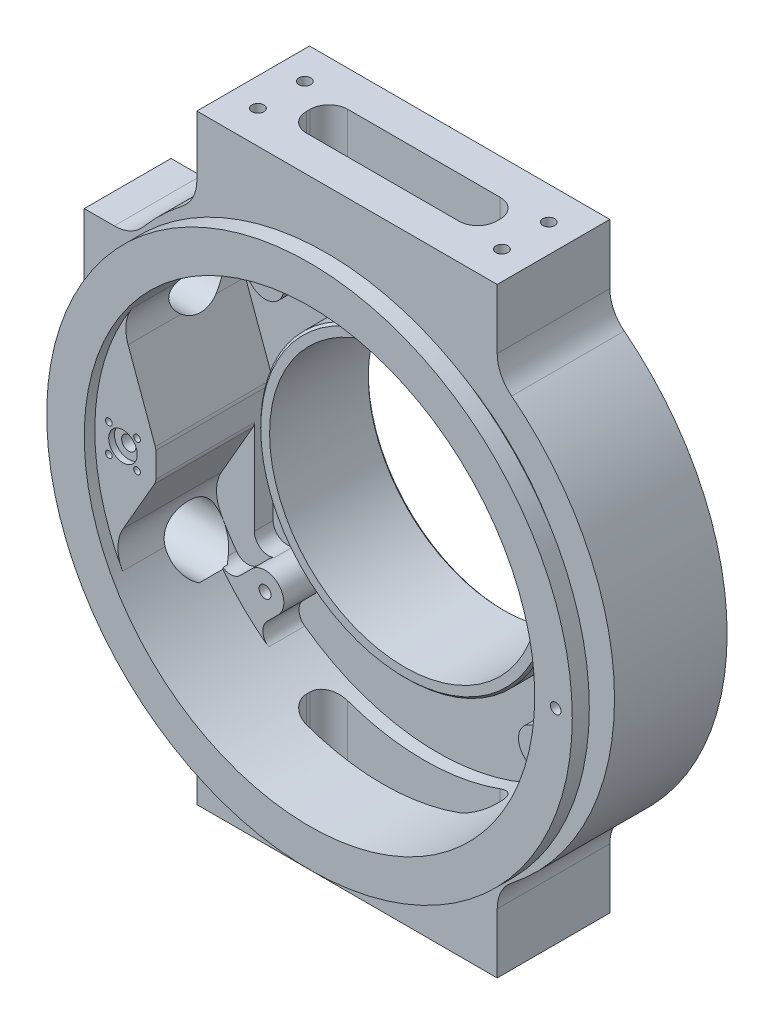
from build123d import *

# Parameters (mm, degrees)
BOSS_EXTRUDE1_DEPTH              = 19.05
SKETCH3_R                        = 74.2188
CUT_EXTRUDE2_DEPTH               = 158.602855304
SKETCH5_R                        = 74.2188
SKETCH5_R_2                      = 45.6438
BOSS_EXTRUDE2_DEPTH              = 47.22876
CUT_EXTRUDE3_DEPTH               = 114.3
F_10_32_TAPPED_HOLE1_D           = 4.0386
F_10_32_TAPPED_HOLE1_DEPTH       = 16.764
F_10_32_TAPPED_HOLE1_TIP         = 1.213317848
F_10_32_TAPPED_HOLE2_D           = 4.0386
F_10_32_TAPPED_HOLE2_DEPTH       = 16.764
F_10_32_TAPPED_HOLE2_TIP         = 1.213317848
SKETCH15_OUTSIDE_W               = 293.192
SKETCH15_OUTSIDE_H               = 267.792
CUT_EXTRUDE7_DEPTH               = 41.275
ROD_POCKET_DEPTH                 = 8.73125
CUT_EXTRUDE11_DEPTH              = 8.73125
SKETCH13_R                       = 2.413
CUT_EXTRUDE5_DEPTH               = 47.22876
CUT_EXTRUDE6_DEPTH               = 39.6875
SKETCH16_R                       = 4.826
CUT_EXTRUDE8_DEPTH               = 1.9558
CHAMFER1_SIZE                    = 3.175
BOSS_EXTRUDE4_DEPTH              = 12.2428
F_10_32_TAPPED_HOLE3_D           = 4.0386
F_10_32_TAPPED_HOLE3_DEPTH       = 12.7
SKETCH23_R                       = 6.35
CUT_EXTRUDE9_DEPTH               = 41.275
F_4_40_TAPPED_HOLE1_D            = 2.2606
F_4_40_TAPPED_HOLE1_DEPTH        = 11.43
F_4_40_TAPPED_HOLE1_TIP          = 0.679152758
BOSS_EXTRUDE5_DEPTH              = 5.15874
SKETCH24_R                       = 9.525
CUT_EXTRUDE10_DEPTH              = 28.575
SKETCH30_R                       = 49.403
SKETCH30_R_2                     = 45.6438
BOSS_EXTRUDE7_DEPTH              = 11.1125
CHAMFER2_SIZE                    = 0.762
BOSS_EXTRUDE8_DEPTH              = 1.18999
SKETCH33_W                       = 1.199119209
SKETCH33_H                       = 2.635463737
CUT_EXTRUDE12_DEPTH              = 1.18999
CUT_EXTRUDE13_DEPTH              = 150.716063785
CUT_EXTRUDE13_DEPTH_BACK         = 150.716063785
F_6_32_TAPPED_HOLE1_D            = 2.7051
F_6_32_TAPPED_HOLE1_DEPTH        = 10.9728
F_6_32_TAPPED_HOLE1_TIP          = 0.81269403
F_42_0_0935_DIAMETER_HOLE1_D     = 2.3749
F_42_0_0935_DIAMETER_HOLE1_DEPTH = 4.7625
F_42_0_0935_DIAMETER_HOLE1_TIP   = 0.713491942
F_10_32_TAPPED_HOLE4_D           = 4.0386
F_10_32_TAPPED_HOLE4_DEPTH       = 13.6144
F_10_32_TAPPED_HOLE4_TIP         = 1.213317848
SKETCH43_R                       = 1.778
CUT_EXTRUDE14_DEPTH              = 9.525


with BuildPart() as part:
    # Sketch1 → Boss-Extrude1 (new, symmetric)
    with BuildSketch(Plane.XY):
        with BuildLine():
            Line((52.363441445, 101.6), (-52.363441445, 101.6))
            ThreePointArc((-52.363441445, 101.6), (-114.3, 0), (-52.363441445, -101.6))
            Line((-52.363441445, -101.6), (52.363441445, -101.6))
            ThreePointArc((52.363441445, -101.6), (114.3, 0), (52.363441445, 101.6))
        make_face()
    extrude(amount=BOSS_EXTRUDE1_DEPTH, both=True)

    # Sketch3 → Cut-Extrude2 (cut, through all)
    with BuildSketch(Plane.XY.offset(19.05)):
        Circle(SKETCH3_R)
    extrude(amount=-CUT_EXTRUDE2_DEPTH, mode=Mode.SUBTRACT)

    # Sketch4 → Revolve1 (revolve)
    with BuildSketch(Plane(origin=(0, 0, 0), x_dir=(1, 0, 0), z_dir=(0, 1, 0))):
        Polygon((76.2, -31.75), (76.2, -28.17876), (74.2188, -28.17876), (74.2188, -19.05), (79.375, -19.05), (79.375, -22.517383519), (88.9, -25.9842), (88.9, -31.75), align=None)
        Polygon((50.8, 19.05), (50.8, 22.517383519), (60.325, 25.9842), (60.325, 31.75), (50.8, 31.75), (50.8, 33.782), (50.038, 34.544), (46.4058, 34.544), (45.6438, 33.782), (45.6438, 19.05), align=None)
    revolve(axis=Axis((0, 0, 0), (0, 0, -1)))


with BuildPart() as revolve1_piece_1:
    # of the separate pieces the step leaves, piece 1, a body of its own (revolve1_pieces)
    add(part.part.solids().sort_by_distance((52.363441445, 101.6, -19.05))[0])



with BuildPart() as revolve1_piece_2:
    # of the separate pieces the step leaves, piece 2, a body of its own (revolve1_pieces)
    add(part.part.solids().sort_by_distance((50.8, 0, -19.05))[0])


with BuildPart() as revolve1_piece_1_1:
    add(revolve1_piece_1.part)

    add(revolve1_piece_2.part)  # Boss-Extrude2 merges Revolve1 piece 2
    # Sketch5 → Boss-Extrude2 (add)
    with BuildSketch(Plane.XY.offset(-19.05)):
        Circle(SKETCH5_R)
        Circle(SKETCH5_R_2, mode=Mode.SUBTRACT)
    extrude(amount=BOSS_EXTRUDE2_DEPTH)

    # Sketch6 → Cut-Extrude3 (cut, symmetric)
    with BuildSketch(Plane(origin=(0, 0, 0), x_dir=(1, 0, 0), z_dir=(0, 1, 0))):
        with BuildLine():
            Line((32.1437, -0.635), (32.1437, 0.635))
            ThreePointArc((32.1437, 0.635), (30.283828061, 5.125128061), (25.7937, 6.985))
            Line((25.7937, 6.985), (-25.7937, 6.985))
            ThreePointArc((-25.7937, 6.985), (-30.283828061, 5.125128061), (-32.1437, 0.635))
            Line((-32.1437, 0.635), (-32.1437, -0.635))
            ThreePointArc((-32.1437, -0.635), (-30.283828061, -5.125128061), (-25.7937, -6.985))
            Line((-25.7937, -6.985), (25.7937, -6.985))
            ThreePointArc((25.7937, -6.985), (30.283828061, -5.125128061), (32.1437, -0.635))
        make_face()
    extrude(amount=CUT_EXTRUDE3_DEPTH, both=True, mode=Mode.SUBTRACT)

    # 10-32 Tapped Hole1
    with Locations(Plane(origin=(0, 101.6, 0), x_dir=(-1, 0, 0), z_dir=(0, 1, 0))):
        with Locations((-41.275, 7.9375), (-41.275, -7.9375), (41.275, -7.9375), (41.275, 7.9375)):
            Hole(F_10_32_TAPPED_HOLE1_D / 2, depth=F_10_32_TAPPED_HOLE1_DEPTH)
            with Locations((0, 0, -(F_10_32_TAPPED_HOLE1_DEPTH + F_10_32_TAPPED_HOLE1_TIP / 2))):  # 118° drill point
                Cone(0, F_10_32_TAPPED_HOLE1_D / 2, F_10_32_TAPPED_HOLE1_TIP, mode=Mode.SUBTRACT)

    # 10-32 Tapped Hole2
    with Locations(Plane.XZ.offset(101.6)):
        with Locations((41.275, -7.9375), (-41.275, 7.9375), (-41.275, -7.9375), (41.275, 7.9375)):
            Hole(F_10_32_TAPPED_HOLE2_D / 2, depth=F_10_32_TAPPED_HOLE2_DEPTH)
            with Locations((0, 0, -(F_10_32_TAPPED_HOLE2_DEPTH + F_10_32_TAPPED_HOLE2_TIP / 2))):  # 118° drill point
                Cone(0, F_10_32_TAPPED_HOLE2_D / 2, F_10_32_TAPPED_HOLE2_TIP, mode=Mode.SUBTRACT)

    # Sketch15 outside → Cut-Extrude7 (cut)
    with BuildSketch(Plane.XY.offset(19.05)):
        Rectangle(SKETCH15_OUTSIDE_W, SKETCH15_OUTSIDE_H)
        with BuildLine():
            Line((50.8, 101.6), (50.8, 81.335171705))
            ThreePointArc((50.8, 81.335171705), (52.086293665, 75.765853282), (55.684615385, 71.324689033))
            ThreePointArc((55.684615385, 71.324689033), (90.4875, 0), (55.684615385, -71.324689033))
            ThreePointArc((55.684615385, -71.324689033), (52.086293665, -75.765853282), (50.8, -81.335171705))
            Line((50.8, -81.335171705), (50.8, -101.6))
            Line((50.8, -101.6), (-50.8, -101.6))
            Line((-50.8, -101.6), (-50.8, -81.335171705))
            ThreePointArc((-50.8, -81.335171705), (-52.086293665, -75.765853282), (-55.684615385, -71.324689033))
            ThreePointArc((-55.684615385, -71.324689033), (-62.703008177, -65.240481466), (-69.060710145, -58.468846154))
            ThreePointArc((-69.060710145, -58.468846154), (-73.411538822, -55.153104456), (-78.753441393, -53.975))
            Line((-78.753441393, -53.975), (-101.6, -53.975))
            Line((-101.6, -53.975), (-101.6, 53.975))
            Line((-101.6, 53.975), (-78.753441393, 53.975))
            ThreePointArc((-78.753441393, 53.975), (-73.411538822, 55.153104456), (-69.060710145, 58.468846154))
            ThreePointArc((-69.060710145, 58.468846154), (-62.703008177, 65.240481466), (-55.684615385, 71.324689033))
            ThreePointArc((-55.684615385, 71.324689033), (-52.086293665, 75.765853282), (-50.8, 81.335171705))
            Line((-50.8, 81.335171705), (-50.8, 101.6))
            Line((-50.8, 101.6), (50.8, 101.6))
        make_face(mode=Mode.SUBTRACT)
    extrude(amount=-CUT_EXTRUDE7_DEPTH, mode=Mode.SUBTRACT)

    # Sketch12 → ROD POCKET (cut)
    with BuildSketch(Plane(origin=(0, 0, -19.05), x_dir=(-1, 0, 0), z_dir=(0, 0, -1))):
        with BuildLine():
            Line((120.65, 82.55), (88.9, 82.55))
            Line((88.9, 82.55), (88.9, 77.884195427))
            Line((88.9, 77.884195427), (61.342951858, 2.17182791))
            ThreePointArc((61.342951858, 2.17182791), (61.677481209, -2.932103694), (65.666499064, -6.133628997))
            Line((65.666499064, -6.133628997), (88.9, -12.35902681))
            Line((88.9, -12.35902681), (88.9, -82.55))
            Line((88.9, -82.55), (120.65, -82.55))
            Line((120.65, -82.55), (120.65, 82.55))
        make_face()
    extrude(amount=-ROD_POCKET_DEPTH, mode=Mode.SUBTRACT)

    # Sketch27 → Cut-Extrude11 (cut)
    with BuildSketch(Plane(origin=(0, 0, -19.05), x_dir=(-1, 0, 0), z_dir=(0, 0, -1))):
        with BuildLine():
            Line((60.96, 0), (60.96, -70.76029694))
            Line((60.96, -70.76029694), (88.9, -66.178287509))
            Line((88.9, -66.178287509), (88.9, -12.35902681))
            Line((88.9, -12.35902681), (65.666499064, -6.133628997))
            ThreePointArc((65.666499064, -6.133628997), (62.272206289, -3.865635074), (60.96, 0))
        make_face()
    extrude(amount=-CUT_EXTRUDE11_DEPTH, mode=Mode.SUBTRACT)

    # Sketch13 → Cut-Extrude5 (cut)
    with BuildSketch(Plane.XY.offset(28.17876)):
        with Locations((-66.675, 0)):
            Circle(SKETCH13_R)
    extrude(amount=-CUT_EXTRUDE5_DEPTH, mode=Mode.SUBTRACT)

    # Sketch14 → Cut-Extrude6 (cut)
    with BuildSketch(Plane.XY.offset(28.17876)):
        with BuildLine():
            Line((-55.987869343, -5.695937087), (-66.66889746, -24.196020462))
            ThreePointArc((-66.66889746, -24.196020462), (-68.369623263, -30.407856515), (-66.804449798, -36.655224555))
            ThreePointArc((-66.804449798, -36.655224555), (76.137070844, -3.096198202), (-63.607532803, 41.958572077))
            ThreePointArc((-63.607532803, 41.958572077), (-65.619405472, 36.448378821), (-64.94037362, 30.62182091))
            Line((-64.94037362, 30.62182091), (-55.753975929, 5.382400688))
            ThreePointArc((-55.753975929, 5.382400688), (-55.610735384, 4.847819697), (-55.5625, 4.296486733))
            Line((-55.5625, 4.296486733), (-55.5625, -4.108437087))
            ThreePointArc((-55.5625, -4.108437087), (-55.670685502, -4.930187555), (-55.987869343, -5.695937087))
        make_face()
    extrude(amount=-CUT_EXTRUDE6_DEPTH, mode=Mode.SUBTRACT)

    # Sketch16 → Cut-Extrude8 (cut)
    with BuildSketch(Plane.XY.offset(28.17876)):
        with Locations((-66.675, 0)):
            Circle(SKETCH16_R)
    extrude(amount=-CUT_EXTRUDE8_DEPTH, mode=Mode.SUBTRACT)

    # Chamfer1
    chamfer1_edges = [revolve1_piece_1_1.edges().sort_by_distance(p)[0] for p in [
        (-69.088, 0, -10.31875),
    ]]
    chamfer(chamfer1_edges, length=CHAMFER1_SIZE)

    # Sketch22 → Boss-Extrude4 (add)
    with BuildSketch(Plane.XY.offset(-11.50874)):
        with BuildLine():
            Line((50.527628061, -41.547371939), (54.389169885, -45.408913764))
            ThreePointArc((54.389169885, -45.408913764), (58.128315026, -46.789302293), (61.607216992, -44.844072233))
            ThreePointArc((61.607216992, -44.844072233), (53.881536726, -53.881536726), (44.844072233, -61.607216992))
            ThreePointArc((44.844072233, -61.607216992), (46.789302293, -58.128315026), (45.408913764, -54.389169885))
            Line((45.408913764, -54.389169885), (41.547371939, -50.527628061))
            ThreePointArc((41.547371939, -50.527628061), (41.547371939, -41.547371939), (50.527628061, -41.547371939))
        make_face()
        with BuildLine():
            Line((-45.408913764, -54.389169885), (-41.547371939, -50.527628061))
            ThreePointArc((-41.547371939, -50.527628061), (-41.547371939, -41.547371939), (-50.527628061, -41.547371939))
            Line((-50.527628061, -41.547371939), (-54.389169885, -45.408913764))
            ThreePointArc((-54.389169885, -45.408913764), (-58.128315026, -46.789302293), (-61.607216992, -44.844072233))
            ThreePointArc((-61.607216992, -44.844072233), (-53.881536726, -53.881536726), (-44.844072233, -61.607216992))
            ThreePointArc((-44.844072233, -61.607216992), (-46.789302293, -58.128315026), (-45.408913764, -54.389169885))
        make_face()
        with BuildLine():
            Line((-50.527628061, 41.547371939), (-54.389169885, 45.408913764))
            ThreePointArc((-54.389169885, 45.408913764), (-58.128315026, 46.789302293), (-61.607216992, 44.844072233))
            ThreePointArc((-61.607216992, 44.844072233), (-53.881536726, 53.881536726), (-44.844072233, 61.607216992))
            ThreePointArc((-44.844072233, 61.607216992), (-46.789302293, 58.128315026), (-45.408913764, 54.389169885))
            Line((-45.408913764, 54.389169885), (-41.547371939, 50.527628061))
            ThreePointArc((-41.547371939, 50.527628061), (-41.547371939, 41.547371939), (-50.527628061, 41.547371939))
        make_face()
        with BuildLine():
            Line((50.527628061, 41.547371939), (54.389169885, 45.408913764))
            ThreePointArc((54.389169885, 45.408913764), (58.128315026, 46.789302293), (61.607216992, 44.844072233))
            ThreePointArc((61.607216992, 44.844072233), (53.881536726, 53.881536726), (44.844072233, 61.607216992))
            ThreePointArc((44.844072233, 61.607216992), (46.789302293, 58.128315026), (45.408913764, 54.389169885))
            Line((45.408913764, 54.389169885), (41.547371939, 50.527628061))
            ThreePointArc((41.547371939, 50.527628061), (41.547371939, 41.547371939), (50.527628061, 41.547371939))
        make_face()
    extrude(amount=BOSS_EXTRUDE4_DEPTH)

    # 10-32 Tapped Hole3
    with Locations(Plane(origin=(42.021190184, -48.270073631, 0.73406), x_dir=(1, 0, 0), z_dir=(0, 0, 1))):
        with Locations((4.016309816, 94.307573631), (4.016309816, 2.232573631), (-88.058690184, 2.232573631), (-88.058690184, 94.307573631)):
            Hole(F_10_32_TAPPED_HOLE3_D / 2, depth=F_10_32_TAPPED_HOLE3_DEPTH)

    # Sketch23 → Cut-Extrude9 (cut)
    with BuildSketch(Plane.ZY.offset(101.6)):
        with Locations(Location((4.365625, -38.1, 0), (0, 0, 270))):
            Circle(SKETCH23_R)
        with Locations(Location((4.365625, 38.1, 0), (0, 0, 270))):
            Circle(SKETCH23_R)
    extrude(amount=-CUT_EXTRUDE9_DEPTH, mode=Mode.SUBTRACT)

    # 4-40 Tapped Hole1
    with Locations(Plane.XY.offset(28.17876)):
        with Locations((-71.4375, -4.7625), (-71.4375, 4.7625), (-61.9125, 4.7625), (-61.9125, -4.7625)):
            Hole(F_4_40_TAPPED_HOLE1_D / 2, depth=F_4_40_TAPPED_HOLE1_DEPTH)
            with Locations((0, 0, -(F_4_40_TAPPED_HOLE1_DEPTH + F_4_40_TAPPED_HOLE1_TIP / 2))):  # 118° drill point
                Cone(0, F_4_40_TAPPED_HOLE1_D / 2, F_4_40_TAPPED_HOLE1_TIP, mode=Mode.SUBTRACT)

    # Sketch28 → Boss-Extrude5 (add)
    with BuildSketch(Plane.XY.offset(-10.31875)):
        with BuildLine():
            Line((-55.5625, -4.108437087), (-55.5625, -35.997268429))
            ThreePointArc((-55.5625, -35.997268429), (-53.345663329, -40.022315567), (-48.758928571, -40.300224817))
            ThreePointArc((-48.758928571, -40.300224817), (-49.69680065, -40.847893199), (-50.527628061, -41.547371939))
            Line((-50.527628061, -41.547371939), (-54.389169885, -45.408913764))
            ThreePointArc((-54.389169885, -45.408913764), (-58.128315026, -46.789302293), (-61.607216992, -44.844072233))
            ThreePointArc((-61.607216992, -44.844072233), (-64.336252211, -40.832421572), (-66.804449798, -36.655224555))
            ThreePointArc((-66.804449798, -36.655224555), (-68.369623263, -30.407856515), (-66.66889746, -24.196020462))
            Line((-66.66889746, -24.196020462), (-55.987869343, -5.695937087))
            ThreePointArc((-55.987869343, -5.695937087), (-55.670685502, -4.930187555), (-55.5625, -4.108437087))
        make_face()
    extrude(amount=BOSS_EXTRUDE5_DEPTH)

    # Sketch24 → Cut-Extrude10 (cut)
    with BuildSketch(Plane(origin=(-88.9, 0, 0), x_dir=(0, 0, -1), z_dir=(1, 0, 0))):
        with Locations(Location((-4.365625, -38.1, 0), (0, 0, 242.576442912))):
            Circle(SKETCH24_R)
        with Locations(Location((-4.365625, 38.1, 0), (0, 0, 231.730914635))):
            Circle(SKETCH24_R)
    extrude(amount=CUT_EXTRUDE10_DEPTH, mode=Mode.SUBTRACT)

    # Sketch30 → Boss-Extrude7 (add)
    with BuildSketch(Plane.XY.offset(-11.50874)):
        Circle(SKETCH30_R)
        Circle(SKETCH30_R_2, mode=Mode.SUBTRACT)
    extrude(amount=BOSS_EXTRUDE7_DEPTH)

    # Chamfer2
    chamfer2_edges = [revolve1_piece_1_1.edges().sort_by_distance(p)[0] for p in [
        (-49.403, 0, -0.39624),
    ]]
    chamfer(chamfer2_edges, length=CHAMFER2_SIZE)

    # Sketch32 → Boss-Extrude8 (add)
    with BuildSketch(Plane(origin=(0, 0, -10.31875), x_dir=(-1, 0, 0), z_dir=(0, 0, -1))):
        with BuildLine():
            Line((60.96, -14.307920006), (60.96, -45.565618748))
            ThreePointArc((60.96, -45.565618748), (57.643219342, -46.802463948), (54.389169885, -45.408913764))
            Line((54.389169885, -45.408913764), (50.527628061, -41.547371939))
            ThreePointArc((50.527628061, -41.547371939), (49.69680065, -40.847893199), (48.758928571, -40.300224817))
            ThreePointArc((48.758928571, -40.300224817), (53.345663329, -40.022315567), (55.5625, -35.997268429))
            Line((55.5625, -35.997268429), (55.5625, -4.108437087))
            ThreePointArc((55.5625, -4.108437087), (55.670685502, -4.930187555), (55.987869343, -5.695937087))
            Line((55.987869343, -5.695937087), (60.96, -14.307920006))
        make_face()
    extrude(amount=BOSS_EXTRUDE8_DEPTH)

    # Sketch33 → Cut-Extrude12 (cut)
    with BuildSketch(Plane(origin=(0, 0, -10.31875), x_dir=(-1, 0, 0), z_dir=(0, 0, -1))):
        with Locations((61.559559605, -45.247115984)):
            Rectangle(SKETCH33_W, SKETCH33_H)
    extrude(amount=CUT_EXTRUDE12_DEPTH, mode=Mode.SUBTRACT)

    # Sketch34 → Cut-Extrude13 (cut, two sides: drawn at the far end of the back side and taken through both)
    with BuildSketch(Plane(origin=(0, 0, -10.31875), x_dir=(-1, 0, 0), z_dir=(0, 0, -1)).offset(-CUT_EXTRUDE13_DEPTH_BACK)):
        Polygon((88.9, -556.243376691), (88.9, -61.369160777), (88.9, 61.482421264), (88.9, 556.356637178), (1078.648431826, 556.356637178), (1078.648431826, -556.243376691), align=None)
    extrude(amount=CUT_EXTRUDE13_DEPTH + CUT_EXTRUDE13_DEPTH_BACK, mode=Mode.SUBTRACT)

    # 6-32 Tapped Hole1
    with Locations(Plane(origin=(0, 0, -10.31875), x_dir=(-1, 0, 0), z_dir=(0, 0, -1))):
        with Locations((79.201455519, 25.683039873), (83.064946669, -23.407269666), (80.052051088, -11.224678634), (80.052051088, 11.224678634)):
            Hole(F_6_32_TAPPED_HOLE1_D / 2, depth=F_6_32_TAPPED_HOLE1_DEPTH)
            with Locations((0, 0, -(F_6_32_TAPPED_HOLE1_DEPTH + F_6_32_TAPPED_HOLE1_TIP / 2))):  # 118° drill point
                Cone(0, F_6_32_TAPPED_HOLE1_D / 2, F_6_32_TAPPED_HOLE1_TIP, mode=Mode.SUBTRACT)

    # 42 _0.0935_ Diameter Hole1
    with Locations(Plane(origin=(0, 0, -10.31875), x_dir=(-1, 0, 0), z_dir=(0, 0, -1))):
        with Locations((77.1921875, -18.216303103), (77.1921875, 18.216303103), (84.7328125, -31.277048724), (84.7328125, 31.277048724)):
            Hole(F_42_0_0935_DIAMETER_HOLE1_D / 2, depth=F_42_0_0935_DIAMETER_HOLE1_DEPTH)
            with Locations((0, 0, -(F_42_0_0935_DIAMETER_HOLE1_DEPTH + F_42_0_0935_DIAMETER_HOLE1_TIP / 2))):  # 118° drill point
                Cone(0, F_42_0_0935_DIAMETER_HOLE1_D / 2, F_42_0_0935_DIAMETER_HOLE1_TIP, mode=Mode.SUBTRACT)

    # 10-32 Tapped Hole4
    with Locations(Plane.ZY.offset(88.9)):
        with Locations((4.365625, -19.05), (4.365625, 19.05)):
            Hole(F_10_32_TAPPED_HOLE4_D / 2, depth=F_10_32_TAPPED_HOLE4_DEPTH)
            with Locations((0, 0, -(F_10_32_TAPPED_HOLE4_DEPTH + F_10_32_TAPPED_HOLE4_TIP / 2))):  # 118° drill point
                Cone(0, F_10_32_TAPPED_HOLE4_D / 2, F_10_32_TAPPED_HOLE4_TIP, mode=Mode.SUBTRACT)

    # Sketch42 → Cut-Revolve1 (revolve, cut)
    with BuildSketch(Plane(origin=(0, 0, 0), x_dir=(1, 0, 0), z_dir=(0, 1, 0))):
        with BuildLine():
            Line((50.8, 31.75), (54.227403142, 31.75))
            Line((54.227403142, 31.75), (54.829125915, 29.504340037))
            ThreePointArc((54.829125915, 29.504340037), (54.785292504, 29.283974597), (54.583780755, 29.1846))
            Line((54.583780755, 29.1846), (51.054, 29.1846))
            ThreePointArc((51.054, 29.1846), (50.874394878, 29.258994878), (50.8, 29.4386))
            Line((50.8, 29.4386), (50.8, 31.75))
        make_face()
    revolve(axis=Axis((0, 0, 0.762528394), (0, 0, -1)), mode=Mode.SUBTRACT)

    # Sketch43 → Cut-Extrude14 (cut)
    with BuildSketch(Plane.XY.offset(31.75)):
        with Locations((83.312, 0)):
            Circle(SKETCH43_R)
    extrude(amount=-CUT_EXTRUDE14_DEPTH, mode=Mode.SUBTRACT)


solid = revolve1_piece_1_1.part
